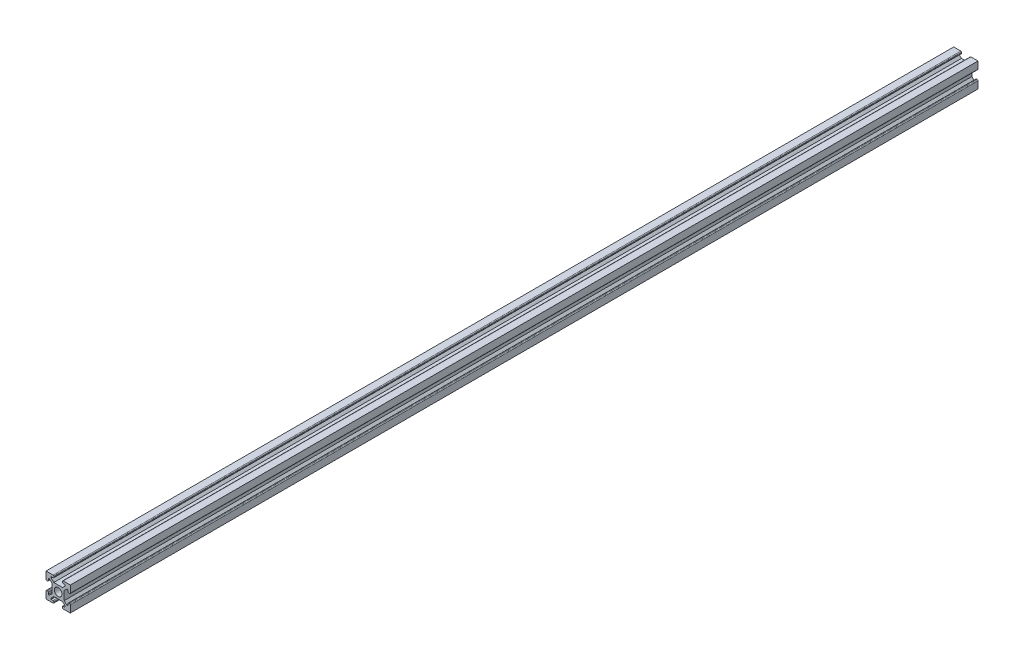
from build123d import *

# Parameters (mm, degrees)
SKETCH1_W           = 20.066
SKETCH1_H           = 20.066
SKETCH1_R           = 6.35
BOSS_EXTRUDE1_DEPTH = 1500.000048
FILLET1_R           = 1.27


with BuildPart() as part:
    # Sketch1 → Boss-Extrude1 (new body)
    # profile 1 of 5: a face of its own
    with BuildSketch(Plane.XY):
        Polygon((-7.10421319, 16.256), (-7.10421319, 20.066), (-20.066, 20.066), (-20.066, 7.10421319), (-16.256, 7.10421319), (-16.256, 11.67621319), (-14.478, 11.67621319), (-10.033, 7.23121319), (-10.033, 10.033), (-7.23121319, 10.033), (-11.67621319, 14.478), (-11.67621319, 16.256), align=None)
    # profile 2 of 5: a face of its own
    with BuildSketch(Plane.XY):
        Polygon((20.066, 20.066), (7.10421319, 20.066), (7.10421319, 16.256), (11.67621319, 16.256), (11.67621319, 14.478), (7.23121319, 10.033), (10.033, 10.033), (10.033, 7.23121319), (14.478, 11.67621319), (16.256, 11.67621319), (16.256, 7.10421319), (20.066, 7.10421319), align=None)
    # profile 3 of 5: a face of its own
    with BuildSketch(Plane.XY):
        Rectangle(SKETCH1_W, SKETCH1_H)
        with Locations(Location((0, 0, 0), (0, 0, 180))):
            Circle(SKETCH1_R, mode=Mode.SUBTRACT)
    # profile 4 of 5: a face of its own
    with BuildSketch(Plane.XY):
        Polygon((20.066, -20.066), (20.066, -7.10421319), (16.256, -7.10421319), (16.256, -11.67621319), (14.478, -11.67621319), (10.033, -7.23121319), (10.033, -10.033), (7.23121319, -10.033), (11.67621319, -14.478), (11.67621319, -16.256), (7.10421319, -16.256), (7.10421319, -20.066), align=None)
    # profile 5 of 5: a face of its own
    with BuildSketch(Plane.XY):
        Polygon((-16.256, -7.10421319), (-20.066, -7.10421319), (-20.066, -20.066), (-7.10421319, -20.066), (-7.10421319, -16.256), (-11.67621319, -16.256), (-11.67621319, -14.478), (-7.23121319, -10.033), (-10.033, -10.033), (-10.033, -7.23121319), (-14.478, -11.67621319), (-16.256, -11.67621319), align=None)
    extrude(amount=BOSS_EXTRUDE1_DEPTH)

    # Fillet1
    fillet1_edges = [part.edges().sort_by_distance(p)[0] for p in [
        (16.256, -7.10421319, 750.000024),
        (20.066, -7.10421319, 750.000024),
        (7.10421319, -20.066, 750.000024),
        (7.10421319, -16.256, 750.000024),
        (-7.10421319, -16.256, 750.000024),
        (-7.10421319, -20.066, 750.000024),
        (-20.066, -7.10421319, 750.000024),
        (-16.256, -7.10421319, 750.000024),
        (-16.256, 7.10421319, 750.000024),
        (-20.066, 7.10421319, 750.000024),
        (-7.10421319, 20.066, 750.000024),
        (-7.10421319, 16.256, 750.000024),
        (7.10421319, 16.256, 750.000024),
        (7.10421319, 20.066, 750.000024),
        (20.066, 7.10421319, 750.000024),
        (16.256, 7.10421319, 750.000024),
    ]]
    fillet(fillet1_edges, radius=FILLET1_R)


solid = part.part
